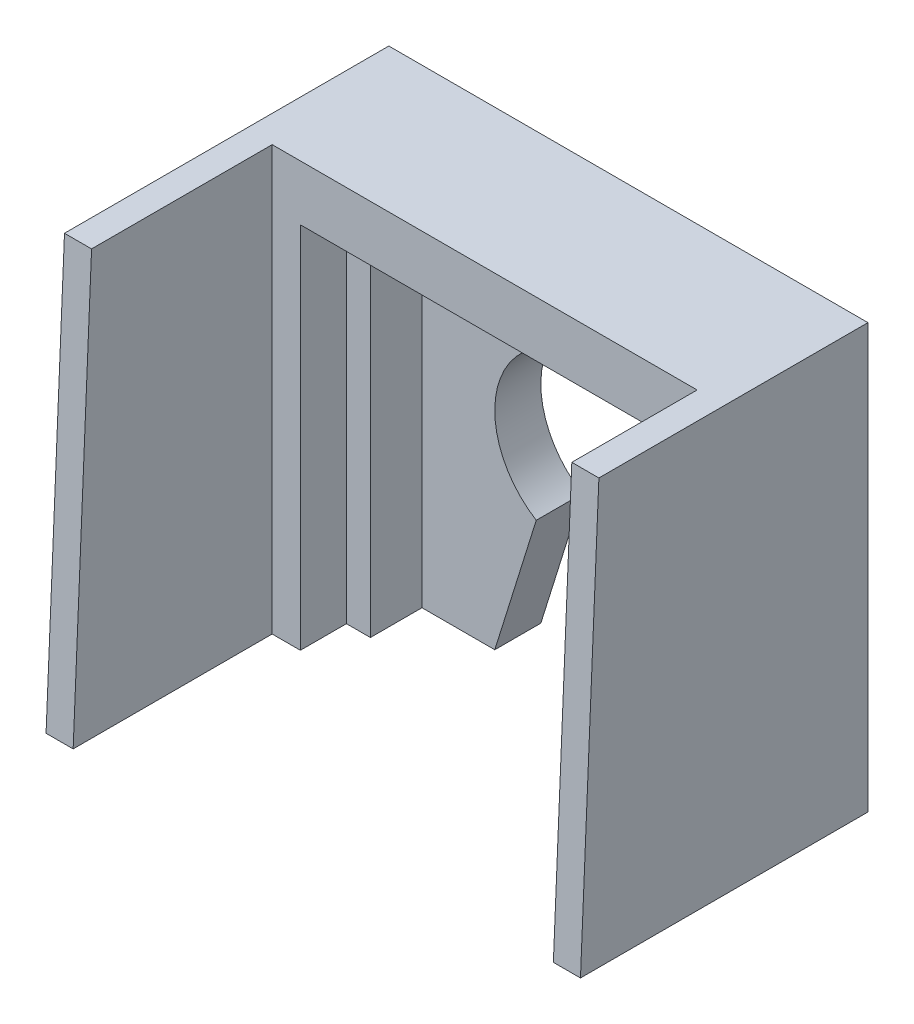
from build123d import *

# Parameters (mm, degrees)
EXTRUDE1_DEPTH     = 2.5
EXTRUDE2_DEPTH     = 7.8
SKETCH3_W          = 1.3
SKETCH3_H          = 20
EXTRUDE3_DEPTH     = 2.8
SKETCH4_W          = 1.47
SKETCH4_H          = 23
EXTRUDE4_DEPTH     = 10.8
CUT_EXTRUDE1_DEPTH = 1.47
CUT_EXTRUDE2_DEPTH = 1.47


with BuildPart() as part:
    # Sketch1 → Extrude1 (new body)
    with BuildSketch(Plane.XY):
        with BuildLine():
            Line((-10, 8.75), (10, 8.75))
            Line((10, 8.75), (10, -11.25))
            Line((10, -11.25), (4.75, -11.25))
            Line((4.75, -11.25), (2.5, -4.038873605))
            ThreePointArc((2.5, -4.038873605), (0, 4.75), (-2.5, -4.038873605))
            Line((-2.5, -4.038873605), (-4.75, -11.25))
            Line((-4.75, -11.25), (-10, -11.25))
            Line((-10, -11.25), (-10, 8.75))
        make_face()
    extrude(amount=EXTRUDE1_DEPTH)

    # Sketch2 → Extrude2 (add)
    with BuildSketch(Plane.XY):
        Polygon((10, -11.25), (10, 8.75), (-10, 8.75), (-10, -11.25), (-13, -11.25), (-13, 11.75), (13, 11.75), (13, -11.25), align=None)
    extrude(amount=EXTRUDE2_DEPTH)

    # Sketch3 → Extrude3 (add)
    with BuildSketch(Plane.XY.offset(2.5)):
        with Locations((-9.35, -1.25)):
            Rectangle(SKETCH3_W, SKETCH3_H)
        with Locations((9.35, -1.25)):
            Rectangle(SKETCH3_W, SKETCH3_H)
    extrude(amount=EXTRUDE3_DEPTH)

    # Sketch4 → Extrude4 (add)
    with BuildSketch(Plane.XY.offset(7.8)):
        with Locations((-12.265, 0.25)):
            Rectangle(SKETCH4_W, SKETCH4_H)
        with Locations((12.265, 0.25)):
            Rectangle(SKETCH4_W, SKETCH4_H)
    extrude(amount=EXTRUDE4_DEPTH)

    # Sketch5 → Cut-Extrude1 (cut)
    with BuildSketch(Plane(origin=(13, 0, 0), x_dir=(0, 0, -1), z_dir=(1, 0, 0))):
        Polygon((-18.6, -11.25), (-18.6, 11.75), (-14.6, 11.75), (-15.6, -11.25), align=None)
    extrude(amount=-CUT_EXTRUDE1_DEPTH, mode=Mode.SUBTRACT)

    # Sketch6 → Cut-Extrude2 (cut)
    with BuildSketch(Plane.ZY.offset(13)):
        Polygon((18.6, 11.75), (18.6, -11.25), (17.6, 11.75), align=None)
    extrude(amount=-CUT_EXTRUDE2_DEPTH, mode=Mode.SUBTRACT)


solid = part.part
